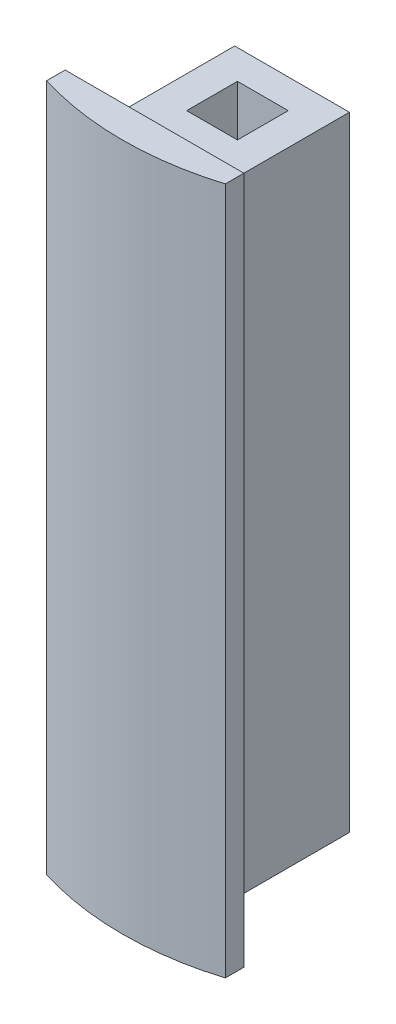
ISO-10303-21;
HEADER;
FILE_DESCRIPTION(('STEP AP214'),'2;1');
FILE_NAME('part.step','',(''),(''),'','','');
FILE_SCHEMA(('AUTOMOTIVE_DESIGN { 1 0 10303 214 1 1 1 1 }'));
ENDSEC;
DATA;
#1=APPLICATION_CONTEXT('core data for automotive mechanical design processes');
#2=APPLICATION_PROTOCOL_DEFINITION('international standard','automotive_design',2000,#1);
#3=PRODUCT_CONTEXT('',#1,'mechanical');
#4=PRODUCT('Part','Part','',(#3));
#5=PRODUCT_RELATED_PRODUCT_CATEGORY('part','',(#4));
#6=PRODUCT_DEFINITION_FORMATION('','',#4);
#7=PRODUCT_DEFINITION_CONTEXT('part definition',#1,'design');
#8=PRODUCT_DEFINITION('design','',#6,#7);
#9=PRODUCT_DEFINITION_SHAPE('','',#8);
#10=(LENGTH_UNIT() NAMED_UNIT(*) SI_UNIT(.MILLI.,.METRE.));
#11=(NAMED_UNIT(*) PLANE_ANGLE_UNIT() SI_UNIT($,.RADIAN.));
#12=(NAMED_UNIT(*) SI_UNIT($,.STERADIAN.) SOLID_ANGLE_UNIT());
#13=UNCERTAINTY_MEASURE_WITH_UNIT(LENGTH_MEASURE(1.E-05),#10,'distance_accuracy_value','');
#14=(GEOMETRIC_REPRESENTATION_CONTEXT(3) GLOBAL_UNCERTAINTY_ASSIGNED_CONTEXT((#13)) GLOBAL_UNIT_ASSIGNED_CONTEXT((#10,
#11,#12)) REPRESENTATION_CONTEXT('',''));
#15=CARTESIAN_POINT('',(0.,0.,0.));
#16=DIRECTION('',(0.,0.,1.));
#17=DIRECTION('',(1.,0.,0.));
#18=AXIS2_PLACEMENT_3D('',#15,#16,#17);
#19=CARTESIAN_POINT('',(-1.5875,-17.5,10.225));
#20=DIRECTION('',(0.,0.,1.));
#21=DIRECTION('',(1.,0.,0.));
#22=AXIS2_PLACEMENT_3D('',#19,#20,#21);
#23=PLANE('',#22);
#24=DIRECTION('',(1.,0.,0.));
#25=VECTOR('',#24,1.);
#26=CARTESIAN_POINT('',(-1.5875,-11.9125,10.225));
#27=LINE('',#26,#25);
#28=CARTESIAN_POINT('',(-1.5875,-11.9125,10.225));
#29=VERTEX_POINT('',#28);
#30=CARTESIAN_POINT('',(1.5875,-11.9125,10.225));
#31=VERTEX_POINT('',#30);
#32=EDGE_CURVE('E408',#29,#31,#27,.T.);
#33=ORIENTED_EDGE('',*,*,#32,.T.);
#34=DIRECTION('',(0.,1.,0.));
#35=VECTOR('',#34,1.);
#36=CARTESIAN_POINT('',(1.5875,-17.5,10.225));
#37=LINE('',#36,#35);
#38=CARTESIAN_POINT('',(1.5875,19.5,10.225));
#39=VERTEX_POINT('',#38);
#40=EDGE_CURVE('E446',#31,#39,#37,.T.);
#41=ORIENTED_EDGE('',*,*,#40,.T.);
#42=DIRECTION('',(1.,0.,0.));
#43=VECTOR('',#42,1.);
#44=CARTESIAN_POINT('',(-1.5875,19.5,10.225));
#45=LINE('',#44,#43);
#46=CARTESIAN_POINT('',(-1.5875,19.5,10.225));
#47=VERTEX_POINT('',#46);
#48=EDGE_CURVE('E418',#47,#39,#45,.T.);
#49=ORIENTED_EDGE('',*,*,#48,.F.);
#50=DIRECTION('',(0.,1.,0.));
#51=VECTOR('',#50,1.);
#52=CARTESIAN_POINT('',(-1.5875,-17.5,10.225));
#53=LINE('',#52,#51);
#54=EDGE_CURVE('E192',#29,#47,#53,.T.);
#55=ORIENTED_EDGE('',*,*,#54,.F.);
#56=EDGE_LOOP('',(#33,#41,#49,#55));
#57=FACE_BOUND('',#56,.T.);
#58=ADVANCED_FACE('F55',(#57),#23,.T.);
#59=CARTESIAN_POINT('',(-3.5875,19.5,8.4));
#60=DIRECTION('',(0.,-1.,0.));
#61=DIRECTION('',(0.,0.,-1.));
#62=AXIS2_PLACEMENT_3D('',#59,#60,#61);
#63=PLANE('',#62);
#64=DIRECTION('',(1.,0.,0.));
#65=VECTOR('',#64,1.);
#66=CARTESIAN_POINT('',(-3.5875,19.5,17.));
#67=LINE('',#66,#65);
#68=CARTESIAN_POINT('',(-3.5875,19.5,17.));
#69=VERTEX_POINT('',#68);
#70=CARTESIAN_POINT('',(3.5875,19.5,17.));
#71=VERTEX_POINT('',#70);
#72=EDGE_CURVE('E204',#69,#71,#67,.T.);
#73=ORIENTED_EDGE('',*,*,#72,.T.);
#74=DIRECTION('',(0.,0.,1.));
#75=VECTOR('',#74,1.);
#76=CARTESIAN_POINT('',(3.5875,19.5,8.4));
#77=LINE('',#76,#75);
#78=CARTESIAN_POINT('',(3.5875,19.5,8.4));
#79=VERTEX_POINT('',#78);
#80=EDGE_CURVE('E209',#79,#71,#77,.T.);
#81=ORIENTED_EDGE('',*,*,#80,.F.);
#82=DIRECTION('',(1.,0.,0.));
#83=VECTOR('',#82,1.);
#84=CARTESIAN_POINT('',(-3.5875,19.5,8.4));
#85=LINE('',#84,#83);
#86=CARTESIAN_POINT('',(-3.5875,19.5,8.4));
#87=VERTEX_POINT('',#86);
#88=EDGE_CURVE('E208',#87,#79,#85,.T.);
#89=ORIENTED_EDGE('',*,*,#88,.F.);
#90=DIRECTION('',(0.,0.,1.));
#91=VECTOR('',#90,1.);
#92=CARTESIAN_POINT('',(-3.5875,19.5,8.4));
#93=LINE('',#92,#91);
#94=EDGE_CURVE('E220',#87,#69,#93,.T.);
#95=ORIENTED_EDGE('',*,*,#94,.T.);
#96=EDGE_LOOP('',(#73,#81,#89,#95));
#97=FACE_BOUND('',#96,.T.);
#98=DIRECTION('',(0.,0.,-1.));
#99=VECTOR('',#98,1.);
#100=CARTESIAN_POINT('',(-1.5875,19.5,13.4));
#101=LINE('',#100,#99);
#102=CARTESIAN_POINT('',(-1.5875,19.5,13.4));
#103=VERTEX_POINT('',#102);
#104=EDGE_CURVE('E415',#103,#47,#101,.T.);
#105=ORIENTED_EDGE('',*,*,#104,.T.);
#106=ORIENTED_EDGE('',*,*,#48,.T.);
#107=DIRECTION('',(0.,0.,-1.));
#108=VECTOR('',#107,1.);
#109=CARTESIAN_POINT('',(1.5875,19.5,13.4));
#110=LINE('',#109,#108);
#111=CARTESIAN_POINT('',(1.5875,19.5,13.4));
#112=VERTEX_POINT('',#111);
#113=EDGE_CURVE('E439',#112,#39,#110,.T.);
#114=ORIENTED_EDGE('',*,*,#113,.F.);
#115=DIRECTION('',(1.,0.,0.));
#116=VECTOR('',#115,1.);
#117=CARTESIAN_POINT('',(-1.5875,19.5,13.4));
#118=LINE('',#117,#116);
#119=EDGE_CURVE('E428',#103,#112,#118,.T.);
#120=ORIENTED_EDGE('',*,*,#119,.F.);
#121=EDGE_LOOP('',(#105,#106,#114,#120));
#122=FACE_BOUND('',#121,.T.);
#123=ADVANCED_FACE('F282',(#97,#122),#63,.F.);
#124=CARTESIAN_POINT('',(0.,0.,17.));
#125=DIRECTION('',(0.,0.,1.));
#126=DIRECTION('',(1.,0.,0.));
#127=AXIS2_PLACEMENT_3D('',#124,#125,#126);
#128=PLANE('',#127);
#129=DIRECTION('',(-1.,0.,0.));
#130=VECTOR('',#129,1.);
#131=CARTESIAN_POINT('',(5.5875,21.5,17.));
#132=LINE('',#131,#130);
#133=CARTESIAN_POINT('',(5.5875,21.5,17.));
#134=VERTEX_POINT('',#133);
#135=CARTESIAN_POINT('',(-5.5875,21.5,17.));
#136=VERTEX_POINT('',#135);
#137=EDGE_CURVE('E235',#134,#136,#132,.T.);
#138=ORIENTED_EDGE('',*,*,#137,.F.);
#139=DIRECTION('',(0.,-1.,0.));
#140=VECTOR('',#139,1.);
#141=CARTESIAN_POINT('',(5.5875,21.5,17.));
#142=LINE('',#141,#140);
#143=CARTESIAN_POINT('',(5.5875,-21.5,17.));
#144=VERTEX_POINT('',#143);
#145=EDGE_CURVE('E247',#134,#144,#142,.T.);
#146=ORIENTED_EDGE('',*,*,#145,.T.);
#147=DIRECTION('',(-1.,0.,0.));
#148=VECTOR('',#147,1.);
#149=CARTESIAN_POINT('',(5.5875,-21.5,17.));
#150=LINE('',#149,#148);
#151=CARTESIAN_POINT('',(-5.5875,-21.5,17.));
#152=VERTEX_POINT('',#151);
#153=EDGE_CURVE('E245',#144,#152,#150,.T.);
#154=ORIENTED_EDGE('',*,*,#153,.T.);
#155=DIRECTION('',(0.,-1.,0.));
#156=VECTOR('',#155,1.);
#157=CARTESIAN_POINT('',(-5.5875,21.5,17.));
#158=LINE('',#157,#156);
#159=EDGE_CURVE('E242',#136,#152,#158,.T.);
#160=ORIENTED_EDGE('',*,*,#159,.F.);
#161=EDGE_LOOP('',(#138,#146,#154,#160));
#162=FACE_BOUND('',#161,.T.);
#163=DIRECTION('',(0.,-1.,0.));
#164=VECTOR('',#163,1.);
#165=CARTESIAN_POINT('',(3.5875,-19.5,17.));
#166=LINE('',#165,#164);
#167=CARTESIAN_POINT('',(3.5875,-19.5,17.));
#168=VERTEX_POINT('',#167);
#169=EDGE_CURVE('E191',#71,#168,#166,.T.);
#170=ORIENTED_EDGE('',*,*,#169,.F.);
#171=ORIENTED_EDGE('',*,*,#72,.F.);
#172=DIRECTION('',(0.,1.,0.));
#173=VECTOR('',#172,1.);
#174=CARTESIAN_POINT('',(-3.5875,-19.5,17.));
#175=LINE('',#174,#173);
#176=CARTESIAN_POINT('',(-3.5875,-19.5,17.));
#177=VERTEX_POINT('',#176);
#178=EDGE_CURVE('E213',#177,#69,#175,.T.);
#179=ORIENTED_EDGE('',*,*,#178,.F.);
#180=DIRECTION('',(-1.,0.,0.));
#181=VECTOR('',#180,1.);
#182=CARTESIAN_POINT('',(-3.5875,-19.5,17.));
#183=LINE('',#182,#181);
#184=EDGE_CURVE('E195',#168,#177,#183,.T.);
#185=ORIENTED_EDGE('',*,*,#184,.F.);
#186=EDGE_LOOP('',(#170,#171,#179,#185));
#187=FACE_BOUND('',#186,.T.);
#188=ADVANCED_FACE('F260',(#162,#187),#128,.F.);
#189=CARTESIAN_POINT('',(5.5875,21.5,17.));
#190=DIRECTION('',(0.,1.,0.));
#191=DIRECTION('',(0.,0.,1.));
#192=AXIS2_PLACEMENT_3D('',#189,#190,#191);
#193=PLANE('',#192);
#194=DIRECTION('',(0.,0.,1.));
#195=VECTOR('',#194,1.);
#196=CARTESIAN_POINT('',(-5.5875,21.5,17.));
#197=LINE('',#196,#195);
#198=CARTESIAN_POINT('',(-5.5875,21.5,18.1598415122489));
#199=VERTEX_POINT('',#198);
#200=EDGE_CURVE('E59',#136,#199,#197,.T.);
#201=ORIENTED_EDGE('',*,*,#200,.T.);
#202=CARTESIAN_POINT('',(0.,21.5,0.));
#203=DIRECTION('',(0.,1.,0.));
#204=DIRECTION('',(0.,0.,1.));
#205=AXIS2_PLACEMENT_3D('',#202,#203,#204);
#206=CIRCLE('',#205,19.);
#207=CARTESIAN_POINT('',(5.5875,21.5,18.1598415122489));
#208=VERTEX_POINT('',#207);
#209=EDGE_CURVE('E232',#199,#208,#206,.T.);
#210=ORIENTED_EDGE('',*,*,#209,.T.);
#211=DIRECTION('',(0.,0.,1.));
#212=VECTOR('',#211,1.);
#213=CARTESIAN_POINT('',(5.5875,21.5,17.));
#214=LINE('',#213,#212);
#215=EDGE_CURVE('E13',#134,#208,#214,.T.);
#216=ORIENTED_EDGE('',*,*,#215,.F.);
#217=ORIENTED_EDGE('',*,*,#137,.T.);
#218=EDGE_LOOP('',(#201,#210,#216,#217));
#219=FACE_BOUND('',#218,.T.);
#220=ADVANCED_FACE('F57',(#219),#193,.T.);
#221=CARTESIAN_POINT('',(5.5875,21.5,17.));
#222=DIRECTION('',(-1.,0.,0.));
#223=DIRECTION('',(0.,-1.,0.));
#224=AXIS2_PLACEMENT_3D('',#221,#222,#223);
#225=PLANE('',#224);
#226=DIRECTION('',(0.,1.,0.));
#227=VECTOR('',#226,1.);
#228=CARTESIAN_POINT('',(5.5875,-30.5,18.1598415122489));
#229=LINE('',#228,#227);
#230=CARTESIAN_POINT('',(5.5875,-21.5,18.1598415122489));
#231=VERTEX_POINT('',#230);
#232=EDGE_CURVE('E236',#231,#208,#229,.T.);
#233=ORIENTED_EDGE('',*,*,#232,.F.);
#234=DIRECTION('',(0.,0.,1.));
#235=VECTOR('',#234,1.);
#236=CARTESIAN_POINT('',(5.5875,-21.5,17.));
#237=LINE('',#236,#235);
#238=EDGE_CURVE('E64',#144,#231,#237,.T.);
#239=ORIENTED_EDGE('',*,*,#238,.F.);
#240=ORIENTED_EDGE('',*,*,#145,.F.);
#241=ORIENTED_EDGE('',*,*,#215,.T.);
#242=EDGE_LOOP('',(#233,#239,#240,#241));
#243=FACE_BOUND('',#242,.T.);
#244=ADVANCED_FACE('F272',(#243),#225,.F.);
#245=CARTESIAN_POINT('',(5.5875,-21.5,17.));
#246=DIRECTION('',(0.,1.,0.));
#247=DIRECTION('',(0.,0.,1.));
#248=AXIS2_PLACEMENT_3D('',#245,#246,#247);
#249=PLANE('',#248);
#250=ORIENTED_EDGE('',*,*,#238,.T.);
#251=CARTESIAN_POINT('',(0.,-21.5,0.));
#252=DIRECTION('',(0.,1.,0.));
#253=DIRECTION('',(0.,0.,1.));
#254=AXIS2_PLACEMENT_3D('',#251,#252,#253);
#255=CIRCLE('',#254,19.);
#256=CARTESIAN_POINT('',(-5.5875,-21.5,18.1598415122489));
#257=VERTEX_POINT('',#256);
#258=EDGE_CURVE('E229',#257,#231,#255,.T.);
#259=ORIENTED_EDGE('',*,*,#258,.F.);
#260=DIRECTION('',(0.,0.,1.));
#261=VECTOR('',#260,1.);
#262=CARTESIAN_POINT('',(-5.5875,-21.5,17.));
#263=LINE('',#262,#261);
#264=EDGE_CURVE('E250',#152,#257,#263,.T.);
#265=ORIENTED_EDGE('',*,*,#264,.F.);
#266=ORIENTED_EDGE('',*,*,#153,.F.);
#267=EDGE_LOOP('',(#250,#259,#265,#266));
#268=FACE_BOUND('',#267,.T.);
#269=ADVANCED_FACE('F267',(#268),#249,.F.);
#270=CARTESIAN_POINT('',(-5.5875,21.5,17.));
#271=DIRECTION('',(-1.,0.,0.));
#272=DIRECTION('',(0.,-1.,0.));
#273=AXIS2_PLACEMENT_3D('',#270,#271,#272);
#274=PLANE('',#273);
#275=ORIENTED_EDGE('',*,*,#264,.T.);
#276=DIRECTION('',(0.,1.,0.));
#277=VECTOR('',#276,1.);
#278=CARTESIAN_POINT('',(-5.5875,-30.5,18.1598415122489));
#279=LINE('',#278,#277);
#280=EDGE_CURVE('E231',#257,#199,#279,.T.);
#281=ORIENTED_EDGE('',*,*,#280,.T.);
#282=ORIENTED_EDGE('',*,*,#200,.F.);
#283=ORIENTED_EDGE('',*,*,#159,.T.);
#284=EDGE_LOOP('',(#275,#281,#282,#283));
#285=FACE_BOUND('',#284,.T.);
#286=ADVANCED_FACE('F258',(#285),#274,.T.);
#287=CARTESIAN_POINT('',(0.,-30.5,0.));
#288=DIRECTION('',(0.,1.,0.));
#289=DIRECTION('',(0.,0.,1.));
#290=AXIS2_PLACEMENT_3D('',#287,#288,#289);
#291=CYLINDRICAL_SURFACE('',#290,19.);
#292=ORIENTED_EDGE('',*,*,#209,.F.);
#293=ORIENTED_EDGE('',*,*,#280,.F.);
#294=ORIENTED_EDGE('',*,*,#258,.T.);
#295=ORIENTED_EDGE('',*,*,#232,.T.);
#296=EDGE_LOOP('',(#292,#293,#294,#295));
#297=FACE_BOUND('',#296,.T.);
#298=ADVANCED_FACE('F270',(#297),#291,.T.);
#299=CARTESIAN_POINT('',(3.5875,-19.5,8.4));
#300=DIRECTION('',(-1.,0.,0.));
#301=DIRECTION('',(0.,0.,1.));
#302=AXIS2_PLACEMENT_3D('',#299,#300,#301);
#303=PLANE('',#302);
#304=ORIENTED_EDGE('',*,*,#169,.T.);
#305=DIRECTION('',(0.,0.,1.));
#306=VECTOR('',#305,1.);
#307=CARTESIAN_POINT('',(3.5875,-19.5,8.4));
#308=LINE('',#307,#306);
#309=CARTESIAN_POINT('',(3.5875,-19.5,8.4));
#310=VERTEX_POINT('',#309);
#311=EDGE_CURVE('E226',#310,#168,#308,.T.);
#312=ORIENTED_EDGE('',*,*,#311,.F.);
#313=DIRECTION('',(0.,-1.,0.));
#314=VECTOR('',#313,1.);
#315=CARTESIAN_POINT('',(3.5875,-19.5,8.4));
#316=LINE('',#315,#314);
#317=EDGE_CURVE('E200',#79,#310,#316,.T.);
#318=ORIENTED_EDGE('',*,*,#317,.F.);
#319=ORIENTED_EDGE('',*,*,#80,.T.);
#320=EDGE_LOOP('',(#304,#312,#318,#319));
#321=FACE_BOUND('',#320,.T.);
#322=ADVANCED_FACE('F315',(#321),#303,.F.);
#323=CARTESIAN_POINT('',(-3.5875,-19.5,8.4));
#324=DIRECTION('',(0.,1.,0.));
#325=DIRECTION('',(0.,0.,1.));
#326=AXIS2_PLACEMENT_3D('',#323,#324,#325);
#327=PLANE('',#326);
#328=ORIENTED_EDGE('',*,*,#184,.T.);
#329=DIRECTION('',(0.,0.,1.));
#330=VECTOR('',#329,1.);
#331=CARTESIAN_POINT('',(-3.5875,-19.5,8.4));
#332=LINE('',#331,#330);
#333=CARTESIAN_POINT('',(-3.5875,-19.5,8.4));
#334=VERTEX_POINT('',#333);
#335=EDGE_CURVE('E223',#334,#177,#332,.T.);
#336=ORIENTED_EDGE('',*,*,#335,.F.);
#337=DIRECTION('',(-1.,0.,0.));
#338=VECTOR('',#337,1.);
#339=CARTESIAN_POINT('',(-3.5875,-19.5,8.4));
#340=LINE('',#339,#338);
#341=EDGE_CURVE('E203',#310,#334,#340,.T.);
#342=ORIENTED_EDGE('',*,*,#341,.F.);
#343=ORIENTED_EDGE('',*,*,#311,.T.);
#344=EDGE_LOOP('',(#328,#336,#342,#343));
#345=FACE_BOUND('',#344,.T.);
#346=ADVANCED_FACE('F311',(#345),#327,.F.);
#347=CARTESIAN_POINT('',(-3.5875,-19.5,8.4));
#348=DIRECTION('',(1.,0.,0.));
#349=DIRECTION('',(0.,0.,-1.));
#350=AXIS2_PLACEMENT_3D('',#347,#348,#349);
#351=PLANE('',#350);
#352=ORIENTED_EDGE('',*,*,#178,.T.);
#353=ORIENTED_EDGE('',*,*,#94,.F.);
#354=DIRECTION('',(0.,1.,0.));
#355=VECTOR('',#354,1.);
#356=CARTESIAN_POINT('',(-3.5875,-19.5,8.4));
#357=LINE('',#356,#355);
#358=EDGE_CURVE('E206',#334,#87,#357,.T.);
#359=ORIENTED_EDGE('',*,*,#358,.F.);
#360=ORIENTED_EDGE('',*,*,#335,.T.);
#361=EDGE_LOOP('',(#352,#353,#359,#360));
#362=FACE_BOUND('',#361,.T.);
#363=ADVANCED_FACE('F305',(#362),#351,.F.);
#364=CARTESIAN_POINT('',(0.,0.,8.4));
#365=DIRECTION('',(0.,0.,-1.));
#366=DIRECTION('',(-1.,0.,0.));
#367=AXIS2_PLACEMENT_3D('',#364,#365,#366);
#368=PLANE('',#367);
#369=DIRECTION('',(0.,-1.,0.));
#370=VECTOR('',#369,1.);
#371=CARTESIAN_POINT('',(1.5875,-11.9125,8.4));
#372=LINE('',#371,#370);
#373=CARTESIAN_POINT('',(1.5875,-11.9125,8.4));
#374=VERTEX_POINT('',#373);
#375=CARTESIAN_POINT('',(1.5875,-15.0875,8.4));
#376=VERTEX_POINT('',#375);
#377=EDGE_CURVE('E72',#374,#376,#372,.T.);
#378=ORIENTED_EDGE('',*,*,#377,.F.);
#379=DIRECTION('',(1.,0.,0.));
#380=VECTOR('',#379,1.);
#381=CARTESIAN_POINT('',(-1.5875,-11.9125,8.4));
#382=LINE('',#381,#380);
#383=CARTESIAN_POINT('',(-1.5875,-11.9125,8.4));
#384=VERTEX_POINT('',#383);
#385=EDGE_CURVE('E407',#384,#374,#382,.T.);
#386=ORIENTED_EDGE('',*,*,#385,.F.);
#387=DIRECTION('',(0.,1.,0.));
#388=VECTOR('',#387,1.);
#389=CARTESIAN_POINT('',(-1.5875,-11.9125,8.4));
#390=LINE('',#389,#388);
#391=CARTESIAN_POINT('',(-1.5875,-15.0875,8.4));
#392=VERTEX_POINT('',#391);
#393=EDGE_CURVE('E412',#392,#384,#390,.T.);
#394=ORIENTED_EDGE('',*,*,#393,.F.);
#395=DIRECTION('',(-1.,0.,0.));
#396=VECTOR('',#395,1.);
#397=CARTESIAN_POINT('',(-1.5875,-15.0875,8.4));
#398=LINE('',#397,#396);
#399=EDGE_CURVE('E174',#376,#392,#398,.T.);
#400=ORIENTED_EDGE('',*,*,#399,.F.);
#401=EDGE_LOOP('',(#378,#386,#394,#400));
#402=FACE_BOUND('',#401,.T.);
#403=ORIENTED_EDGE('',*,*,#317,.T.);
#404=ORIENTED_EDGE('',*,*,#341,.T.);
#405=ORIENTED_EDGE('',*,*,#358,.T.);
#406=ORIENTED_EDGE('',*,*,#88,.T.);
#407=EDGE_LOOP('',(#403,#404,#405,#406));
#408=FACE_BOUND('',#407,.T.);
#409=ADVANCED_FACE('F302',(#402,#408),#368,.T.);
#410=CARTESIAN_POINT('',(-1.5875,-17.5,13.4));
#411=DIRECTION('',(1.,0.,0.));
#412=DIRECTION('',(0.,0.,-1.));
#413=AXIS2_PLACEMENT_3D('',#410,#411,#412);
#414=PLANE('',#413);
#415=ORIENTED_EDGE('',*,*,#104,.F.);
#416=DIRECTION('',(0.,1.,0.));
#417=VECTOR('',#416,1.);
#418=CARTESIAN_POINT('',(-1.5875,-17.5,13.4));
#419=LINE('',#418,#417);
#420=CARTESIAN_POINT('',(-1.5875,-17.5,13.4));
#421=VERTEX_POINT('',#420);
#422=EDGE_CURVE('E435',#421,#103,#419,.T.);
#423=ORIENTED_EDGE('',*,*,#422,.F.);
#424=DIRECTION('',(0.,0.,-1.));
#425=VECTOR('',#424,1.);
#426=CARTESIAN_POINT('',(-1.5875,-17.5,13.4));
#427=LINE('',#426,#425);
#428=CARTESIAN_POINT('',(-1.5875,-17.5,10.225));
#429=VERTEX_POINT('',#428);
#430=EDGE_CURVE('E190',#421,#429,#427,.T.);
#431=ORIENTED_EDGE('',*,*,#430,.T.);
#432=CARTESIAN_POINT('',(-1.5875,-15.0875,10.225));
#433=VERTEX_POINT('',#432);
#434=EDGE_CURVE('E183',#429,#433,#53,.T.);
#435=ORIENTED_EDGE('',*,*,#434,.T.);
#436=DIRECTION('',(0.,0.,-1.));
#437=VECTOR('',#436,1.);
#438=CARTESIAN_POINT('',(-1.5875,-15.0875,19.001));
#439=LINE('',#438,#437);
#440=EDGE_CURVE('E168',#433,#392,#439,.T.);
#441=ORIENTED_EDGE('',*,*,#440,.T.);
#442=ORIENTED_EDGE('',*,*,#393,.T.);
#443=DIRECTION('',(0.,0.,-1.));
#444=VECTOR('',#443,1.);
#445=CARTESIAN_POINT('',(-1.5875,-11.9125,19.001));
#446=LINE('',#445,#444);
#447=EDGE_CURVE('E185',#29,#384,#446,.T.);
#448=ORIENTED_EDGE('',*,*,#447,.F.);
#449=ORIENTED_EDGE('',*,*,#54,.T.);
#450=EDGE_LOOP('',(#415,#423,#431,#435,#441,#442,#448,#449));
#451=FACE_BOUND('',#450,.T.);
#452=ADVANCED_FACE('F188',(#451),#414,.T.);
#453=DIRECTION('',(-1.,0.,0.));
#454=VECTOR('',#453,1.);
#455=CARTESIAN_POINT('',(-1.5875,-15.0875,10.225));
#456=LINE('',#455,#454);
#457=CARTESIAN_POINT('',(1.5875,-15.0875,10.225));
#458=VERTEX_POINT('',#457);
#459=EDGE_CURVE('E171',#458,#433,#456,.T.);
#460=ORIENTED_EDGE('',*,*,#459,.T.);
#461=ORIENTED_EDGE('',*,*,#434,.F.);
#462=DIRECTION('',(1.,0.,0.));
#463=VECTOR('',#462,1.);
#464=CARTESIAN_POINT('',(-1.5875,-17.5,10.225));
#465=LINE('',#464,#463);
#466=CARTESIAN_POINT('',(1.5875,-17.5,10.225));
#467=VERTEX_POINT('',#466);
#468=EDGE_CURVE('E427',#429,#467,#465,.T.);
#469=ORIENTED_EDGE('',*,*,#468,.T.);
#470=EDGE_CURVE('E184',#467,#458,#37,.T.);
#471=ORIENTED_EDGE('',*,*,#470,.T.);
#472=EDGE_LOOP('',(#460,#461,#469,#471));
#473=FACE_BOUND('',#472,.T.);
#474=ADVANCED_FACE('F182',(#473),#23,.T.);
#475=CARTESIAN_POINT('',(1.5875,-17.5,13.4));
#476=DIRECTION('',(1.,0.,0.));
#477=DIRECTION('',(0.,0.,-1.));
#478=AXIS2_PLACEMENT_3D('',#475,#476,#477);
#479=PLANE('',#478);
#480=ORIENTED_EDGE('',*,*,#113,.T.);
#481=ORIENTED_EDGE('',*,*,#40,.F.);
#482=DIRECTION('',(0.,0.,-1.));
#483=VECTOR('',#482,1.);
#484=CARTESIAN_POINT('',(1.5875,-11.9125,19.001));
#485=LINE('',#484,#483);
#486=EDGE_CURVE('E410',#31,#374,#485,.T.);
#487=ORIENTED_EDGE('',*,*,#486,.T.);
#488=ORIENTED_EDGE('',*,*,#377,.T.);
#489=DIRECTION('',(0.,0.,-1.));
#490=VECTOR('',#489,1.);
#491=CARTESIAN_POINT('',(1.5875,-15.0875,19.001));
#492=LINE('',#491,#490);
#493=EDGE_CURVE('E76',#458,#376,#492,.T.);
#494=ORIENTED_EDGE('',*,*,#493,.F.);
#495=ORIENTED_EDGE('',*,*,#470,.F.);
#496=DIRECTION('',(0.,0.,-1.));
#497=VECTOR('',#496,1.);
#498=CARTESIAN_POINT('',(1.5875,-17.5,13.4));
#499=LINE('',#498,#497);
#500=CARTESIAN_POINT('',(1.5875,-17.5,13.4));
#501=VERTEX_POINT('',#500);
#502=EDGE_CURVE('E430',#501,#467,#499,.T.);
#503=ORIENTED_EDGE('',*,*,#502,.F.);
#504=DIRECTION('',(0.,1.,0.));
#505=VECTOR('',#504,1.);
#506=CARTESIAN_POINT('',(1.5875,-17.5,13.4));
#507=LINE('',#506,#505);
#508=EDGE_CURVE('E445',#501,#112,#507,.T.);
#509=ORIENTED_EDGE('',*,*,#508,.T.);
#510=EDGE_LOOP('',(#480,#481,#487,#488,#494,#495,#503,#509));
#511=FACE_BOUND('',#510,.T.);
#512=ADVANCED_FACE('F296',(#511),#479,.F.);
#513=CARTESIAN_POINT('',(-1.5875,-17.5,13.4));
#514=DIRECTION('',(0.,0.,1.));
#515=DIRECTION('',(1.,0.,0.));
#516=AXIS2_PLACEMENT_3D('',#513,#514,#515);
#517=PLANE('',#516);
#518=ORIENTED_EDGE('',*,*,#119,.T.);
#519=ORIENTED_EDGE('',*,*,#508,.F.);
#520=DIRECTION('',(1.,0.,0.));
#521=VECTOR('',#520,1.);
#522=CARTESIAN_POINT('',(-1.5875,-17.5,13.4));
#523=LINE('',#522,#521);
#524=EDGE_CURVE('E433',#421,#501,#523,.T.);
#525=ORIENTED_EDGE('',*,*,#524,.F.);
#526=ORIENTED_EDGE('',*,*,#422,.T.);
#527=EDGE_LOOP('',(#518,#519,#525,#526));
#528=FACE_BOUND('',#527,.T.);
#529=ADVANCED_FACE('F301',(#528),#517,.F.);
#530=CARTESIAN_POINT('',(0.,-17.5,0.));
#531=DIRECTION('',(0.,-1.,0.));
#532=DIRECTION('',(0.,0.,-1.));
#533=AXIS2_PLACEMENT_3D('',#530,#531,#532);
#534=PLANE('',#533);
#535=ORIENTED_EDGE('',*,*,#430,.F.);
#536=ORIENTED_EDGE('',*,*,#524,.T.);
#537=ORIENTED_EDGE('',*,*,#502,.T.);
#538=ORIENTED_EDGE('',*,*,#468,.F.);
#539=EDGE_LOOP('',(#535,#536,#537,#538));
#540=FACE_BOUND('',#539,.T.);
#541=ADVANCED_FACE('F355',(#540),#534,.F.);
#542=CARTESIAN_POINT('',(-1.5875,-11.9125,19.001));
#543=DIRECTION('',(0.,1.,0.));
#544=DIRECTION('',(0.,0.,1.));
#545=AXIS2_PLACEMENT_3D('',#542,#543,#544);
#546=PLANE('',#545);
#547=ORIENTED_EDGE('',*,*,#447,.T.);
#548=ORIENTED_EDGE('',*,*,#385,.T.);
#549=ORIENTED_EDGE('',*,*,#486,.F.);
#550=ORIENTED_EDGE('',*,*,#32,.F.);
#551=EDGE_LOOP('',(#547,#548,#549,#550));
#552=FACE_BOUND('',#551,.T.);
#553=ADVANCED_FACE('F364',(#552),#546,.F.);
#554=CARTESIAN_POINT('',(-1.5875,-15.0875,19.001));
#555=DIRECTION('',(0.,-1.,0.));
#556=DIRECTION('',(0.,0.,-1.));
#557=AXIS2_PLACEMENT_3D('',#554,#555,#556);
#558=PLANE('',#557);
#559=ORIENTED_EDGE('',*,*,#493,.T.);
#560=ORIENTED_EDGE('',*,*,#399,.T.);
#561=ORIENTED_EDGE('',*,*,#440,.F.);
#562=ORIENTED_EDGE('',*,*,#459,.F.);
#563=EDGE_LOOP('',(#559,#560,#561,#562));
#564=FACE_BOUND('',#563,.T.);
#565=ADVANCED_FACE('F170',(#564),#558,.F.);
#566=CLOSED_SHELL('',(#58,#123,#188,#220,#244,#269,#286,#298,#322,#346,#363,#409,#452,#474,#512,
#529,#541,#553,#565));
#567=MANIFOLD_SOLID_BREP('B2',#566);
#568=ADVANCED_BREP_SHAPE_REPRESENTATION('',(#18,#567),#14);
#569=SHAPE_DEFINITION_REPRESENTATION(#9,#568);
ENDSEC;
END-ISO-10303-21;
